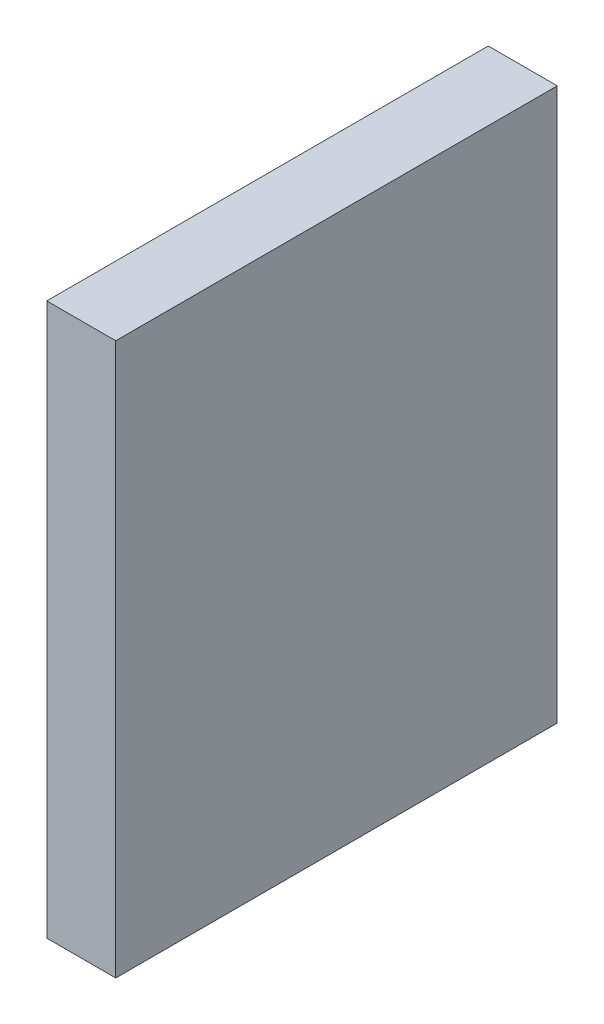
ISO-10303-21;
HEADER;
FILE_DESCRIPTION(('STEP AP214'),'2;1');
FILE_NAME('part.step','',(''),(''),'','','');
FILE_SCHEMA(('AUTOMOTIVE_DESIGN { 1 0 10303 214 1 1 1 1 }'));
ENDSEC;
DATA;
#1=APPLICATION_CONTEXT('core data for automotive mechanical design processes');
#2=APPLICATION_PROTOCOL_DEFINITION('international standard','automotive_design',2000,#1);
#3=PRODUCT_CONTEXT('',#1,'mechanical');
#4=PRODUCT('Part','Part','',(#3));
#5=PRODUCT_RELATED_PRODUCT_CATEGORY('part','',(#4));
#6=PRODUCT_DEFINITION_FORMATION('','',#4);
#7=PRODUCT_DEFINITION_CONTEXT('part definition',#1,'design');
#8=PRODUCT_DEFINITION('design','',#6,#7);
#9=PRODUCT_DEFINITION_SHAPE('','',#8);
#10=(LENGTH_UNIT() NAMED_UNIT(*) SI_UNIT(.MILLI.,.METRE.));
#11=(NAMED_UNIT(*) PLANE_ANGLE_UNIT() SI_UNIT($,.RADIAN.));
#12=(NAMED_UNIT(*) SI_UNIT($,.STERADIAN.) SOLID_ANGLE_UNIT());
#13=UNCERTAINTY_MEASURE_WITH_UNIT(LENGTH_MEASURE(1.E-05),#10,'distance_accuracy_value','');
#14=(GEOMETRIC_REPRESENTATION_CONTEXT(3) GLOBAL_UNCERTAINTY_ASSIGNED_CONTEXT((#13)) GLOBAL_UNIT_ASSIGNED_CONTEXT((#10,
#11,#12)) REPRESENTATION_CONTEXT('',''));
#15=CARTESIAN_POINT('',(0.,0.,0.));
#16=DIRECTION('',(0.,0.,1.));
#17=DIRECTION('',(1.,0.,0.));
#18=AXIS2_PLACEMENT_3D('',#15,#16,#17);
#19=CARTESIAN_POINT('',(10.,0.,0.));
#20=DIRECTION('',(0.,0.,-1.));
#21=DIRECTION('',(-1.,0.,0.));
#22=AXIS2_PLACEMENT_3D('',#19,#20,#21);
#23=PLANE('',#22);
#24=DIRECTION('',(0.,-1.,0.));
#25=VECTOR('',#24,1.);
#26=CARTESIAN_POINT('',(0.,0.,0.));
#27=LINE('',#26,#25);
#28=CARTESIAN_POINT('',(0.,80.,0.));
#29=VERTEX_POINT('',#28);
#30=CARTESIAN_POINT('',(0.,0.,0.));
#31=VERTEX_POINT('',#30);
#32=EDGE_CURVE('E98',#29,#31,#27,.T.);
#33=ORIENTED_EDGE('',*,*,#32,.T.);
#34=DIRECTION('',(-1.,0.,0.));
#35=VECTOR('',#34,1.);
#36=CARTESIAN_POINT('',(10.,0.,0.));
#37=LINE('',#36,#35);
#38=CARTESIAN_POINT('',(10.,0.,0.));
#39=VERTEX_POINT('',#38);
#40=EDGE_CURVE('E11',#39,#31,#37,.T.);
#41=ORIENTED_EDGE('',*,*,#40,.F.);
#42=DIRECTION('',(0.,-1.,0.));
#43=VECTOR('',#42,1.);
#44=CARTESIAN_POINT('',(10.,0.,0.));
#45=LINE('',#44,#43);
#46=CARTESIAN_POINT('',(10.,80.,0.));
#47=VERTEX_POINT('',#46);
#48=EDGE_CURVE('E86',#47,#39,#45,.T.);
#49=ORIENTED_EDGE('',*,*,#48,.F.);
#50=DIRECTION('',(-1.,0.,0.));
#51=VECTOR('',#50,1.);
#52=CARTESIAN_POINT('',(10.,80.,0.));
#53=LINE('',#52,#51);
#54=EDGE_CURVE('E94',#47,#29,#53,.T.);
#55=ORIENTED_EDGE('',*,*,#54,.T.);
#56=EDGE_LOOP('',(#33,#41,#49,#55));
#57=FACE_BOUND('',#56,.T.);
#58=ADVANCED_FACE('F35',(#57),#23,.F.);
#59=CARTESIAN_POINT('',(10.,0.,0.));
#60=DIRECTION('',(0.,1.,0.));
#61=DIRECTION('',(0.,0.,1.));
#62=AXIS2_PLACEMENT_3D('',#59,#60,#61);
#63=PLANE('',#62);
#64=DIRECTION('',(0.,0.,-1.));
#65=VECTOR('',#64,1.);
#66=CARTESIAN_POINT('',(0.,0.,0.));
#67=LINE('',#66,#65);
#68=CARTESIAN_POINT('',(0.,0.,-64.));
#69=VERTEX_POINT('',#68);
#70=EDGE_CURVE('E90',#31,#69,#67,.T.);
#71=ORIENTED_EDGE('',*,*,#70,.T.);
#72=DIRECTION('',(-1.,0.,0.));
#73=VECTOR('',#72,1.);
#74=CARTESIAN_POINT('',(10.,0.,-64.));
#75=LINE('',#74,#73);
#76=CARTESIAN_POINT('',(10.,0.,-64.));
#77=VERTEX_POINT('',#76);
#78=EDGE_CURVE('E43',#77,#69,#75,.T.);
#79=ORIENTED_EDGE('',*,*,#78,.F.);
#80=DIRECTION('',(0.,0.,-1.));
#81=VECTOR('',#80,1.);
#82=CARTESIAN_POINT('',(10.,0.,0.));
#83=LINE('',#82,#81);
#84=EDGE_CURVE('E81',#39,#77,#83,.T.);
#85=ORIENTED_EDGE('',*,*,#84,.F.);
#86=ORIENTED_EDGE('',*,*,#40,.T.);
#87=EDGE_LOOP('',(#71,#79,#85,#86));
#88=FACE_BOUND('',#87,.T.);
#89=ADVANCED_FACE('F89',(#88),#63,.F.);
#90=CARTESIAN_POINT('',(10.,0.,-64.));
#91=DIRECTION('',(0.,0.,1.));
#92=DIRECTION('',(1.,0.,0.));
#93=AXIS2_PLACEMENT_3D('',#90,#91,#92);
#94=PLANE('',#93);
#95=DIRECTION('',(0.,1.,0.));
#96=VECTOR('',#95,1.);
#97=CARTESIAN_POINT('',(0.,0.,-64.));
#98=LINE('',#97,#96);
#99=CARTESIAN_POINT('',(0.,80.,-64.));
#100=VERTEX_POINT('',#99);
#101=EDGE_CURVE('E68',#69,#100,#98,.T.);
#102=ORIENTED_EDGE('',*,*,#101,.T.);
#103=DIRECTION('',(-1.,0.,0.));
#104=VECTOR('',#103,1.);
#105=CARTESIAN_POINT('',(10.,80.,-64.));
#106=LINE('',#105,#104);
#107=CARTESIAN_POINT('',(10.,80.,-64.));
#108=VERTEX_POINT('',#107);
#109=EDGE_CURVE('E91',#108,#100,#106,.T.);
#110=ORIENTED_EDGE('',*,*,#109,.F.);
#111=DIRECTION('',(0.,1.,0.));
#112=VECTOR('',#111,1.);
#113=CARTESIAN_POINT('',(10.,0.,-64.));
#114=LINE('',#113,#112);
#115=EDGE_CURVE('E84',#77,#108,#114,.T.);
#116=ORIENTED_EDGE('',*,*,#115,.F.);
#117=ORIENTED_EDGE('',*,*,#78,.T.);
#118=EDGE_LOOP('',(#102,#110,#116,#117));
#119=FACE_BOUND('',#118,.T.);
#120=ADVANCED_FACE('F92',(#119),#94,.F.);
#121=CARTESIAN_POINT('',(10.,80.,0.));
#122=DIRECTION('',(0.,-1.,0.));
#123=DIRECTION('',(0.,0.,-1.));
#124=AXIS2_PLACEMENT_3D('',#121,#122,#123);
#125=PLANE('',#124);
#126=DIRECTION('',(0.,0.,1.));
#127=VECTOR('',#126,1.);
#128=CARTESIAN_POINT('',(0.,80.,0.));
#129=LINE('',#128,#127);
#130=EDGE_CURVE('E74',#100,#29,#129,.T.);
#131=ORIENTED_EDGE('',*,*,#130,.T.);
#132=ORIENTED_EDGE('',*,*,#54,.F.);
#133=DIRECTION('',(0.,0.,1.));
#134=VECTOR('',#133,1.);
#135=CARTESIAN_POINT('',(10.,80.,0.));
#136=LINE('',#135,#134);
#137=EDGE_CURVE('E51',#108,#47,#136,.T.);
#138=ORIENTED_EDGE('',*,*,#137,.F.);
#139=ORIENTED_EDGE('',*,*,#109,.T.);
#140=EDGE_LOOP('',(#131,#132,#138,#139));
#141=FACE_BOUND('',#140,.T.);
#142=ADVANCED_FACE('F105',(#141),#125,.F.);
#143=CARTESIAN_POINT('',(10.,0.,0.));
#144=DIRECTION('',(-1.,0.,0.));
#145=DIRECTION('',(0.,0.,1.));
#146=AXIS2_PLACEMENT_3D('',#143,#144,#145);
#147=PLANE('',#146);
#148=ORIENTED_EDGE('',*,*,#48,.T.);
#149=ORIENTED_EDGE('',*,*,#84,.T.);
#150=ORIENTED_EDGE('',*,*,#115,.T.);
#151=ORIENTED_EDGE('',*,*,#137,.T.);
#152=EDGE_LOOP('',(#148,#149,#150,#151));
#153=FACE_BOUND('',#152,.T.);
#154=ADVANCED_FACE('F82',(#153),#147,.F.);
#155=CARTESIAN_POINT('',(0.,0.,0.));
#156=DIRECTION('',(-1.,0.,0.));
#157=DIRECTION('',(0.,0.,1.));
#158=AXIS2_PLACEMENT_3D('',#155,#156,#157);
#159=PLANE('',#158);
#160=ORIENTED_EDGE('',*,*,#32,.F.);
#161=ORIENTED_EDGE('',*,*,#130,.F.);
#162=ORIENTED_EDGE('',*,*,#101,.F.);
#163=ORIENTED_EDGE('',*,*,#70,.F.);
#164=EDGE_LOOP('',(#160,#161,#162,#163));
#165=FACE_BOUND('',#164,.T.);
#166=ADVANCED_FACE('F108',(#165),#159,.T.);
#167=CLOSED_SHELL('',(#58,#89,#120,#142,#154,#166));
#168=MANIFOLD_SOLID_BREP('B2',#167);
#169=ADVANCED_BREP_SHAPE_REPRESENTATION('',(#18,#168),#14);
#170=SHAPE_DEFINITION_REPRESENTATION(#9,#169);
ENDSEC;
END-ISO-10303-21;
